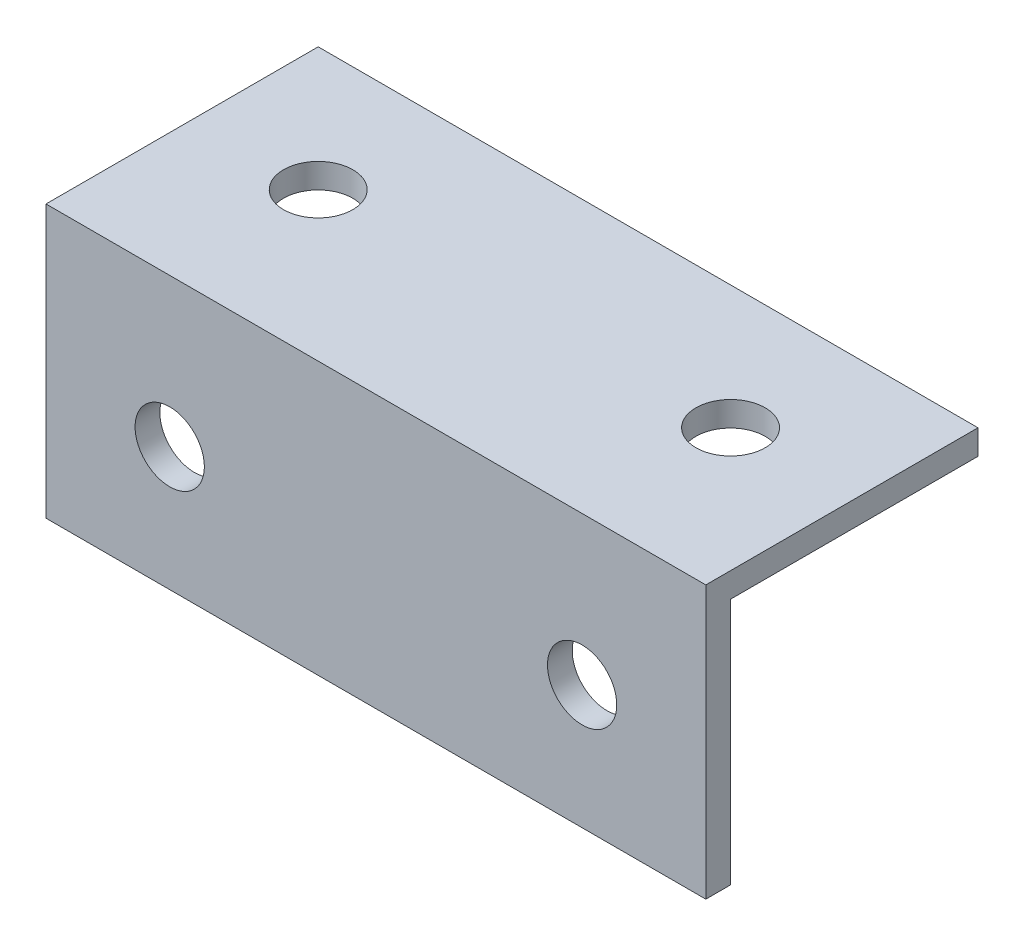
ISO-10303-21;
HEADER;
FILE_DESCRIPTION(('STEP AP214'),'2;1');
FILE_NAME('part.step','',(''),(''),'','','');
FILE_SCHEMA(('AUTOMOTIVE_DESIGN { 1 0 10303 214 1 1 1 1 }'));
ENDSEC;
DATA;
#1=APPLICATION_CONTEXT('core data for automotive mechanical design processes');
#2=APPLICATION_PROTOCOL_DEFINITION('international standard','automotive_design',2000,#1);
#3=PRODUCT_CONTEXT('',#1,'mechanical');
#4=PRODUCT('Part','Part','',(#3));
#5=PRODUCT_RELATED_PRODUCT_CATEGORY('part','',(#4));
#6=PRODUCT_DEFINITION_FORMATION('','',#4);
#7=PRODUCT_DEFINITION_CONTEXT('part definition',#1,'design');
#8=PRODUCT_DEFINITION('design','',#6,#7);
#9=PRODUCT_DEFINITION_SHAPE('','',#8);
#10=(LENGTH_UNIT() NAMED_UNIT(*) SI_UNIT(.MILLI.,.METRE.));
#11=(NAMED_UNIT(*) PLANE_ANGLE_UNIT() SI_UNIT($,.RADIAN.));
#12=(NAMED_UNIT(*) SI_UNIT($,.STERADIAN.) SOLID_ANGLE_UNIT());
#13=UNCERTAINTY_MEASURE_WITH_UNIT(LENGTH_MEASURE(1.E-05),#10,'distance_accuracy_value','');
#14=(GEOMETRIC_REPRESENTATION_CONTEXT(3) GLOBAL_UNCERTAINTY_ASSIGNED_CONTEXT((#13)) GLOBAL_UNIT_ASSIGNED_CONTEXT((#10,
#11,#12)) REPRESENTATION_CONTEXT('',''));
#15=CARTESIAN_POINT('',(0.,0.,0.));
#16=DIRECTION('',(0.,0.,1.));
#17=DIRECTION('',(1.,0.,0.));
#18=AXIS2_PLACEMENT_3D('',#15,#16,#17);
#19=CARTESIAN_POINT('',(50.8000000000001,-19.05,1.90499999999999));
#20=DIRECTION('',(0.,1.,0.));
#21=DIRECTION('',(0.,0.,1.));
#22=AXIS2_PLACEMENT_3D('',#19,#20,#21);
#23=PLANE('',#22);
#24=DIRECTION('',(0.,0.,-1.));
#25=VECTOR('',#24,1.);
#26=CARTESIAN_POINT('',(0.,-19.05,1.90499999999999));
#27=LINE('',#26,#25);
#28=CARTESIAN_POINT('',(0.,-19.05,1.90499999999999));
#29=VERTEX_POINT('',#28);
#30=CARTESIAN_POINT('',(0.,-19.05,0.));
#31=VERTEX_POINT('',#30);
#32=EDGE_CURVE('E140',#29,#31,#27,.T.);
#33=ORIENTED_EDGE('',*,*,#32,.T.);
#34=DIRECTION('',(-1.,0.,0.));
#35=VECTOR('',#34,1.);
#36=CARTESIAN_POINT('',(50.8000000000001,-19.05,0.));
#37=LINE('',#36,#35);
#38=CARTESIAN_POINT('',(50.8000000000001,-19.05,0.));
#39=VERTEX_POINT('',#38);
#40=EDGE_CURVE('E11',#39,#31,#37,.T.);
#41=ORIENTED_EDGE('',*,*,#40,.F.);
#42=DIRECTION('',(0.,0.,-1.));
#43=VECTOR('',#42,1.);
#44=CARTESIAN_POINT('',(50.8000000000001,-19.05,1.90499999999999));
#45=LINE('',#44,#43);
#46=CARTESIAN_POINT('',(50.8000000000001,-19.05,1.90499999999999));
#47=VERTEX_POINT('',#46);
#48=EDGE_CURVE('E152',#47,#39,#45,.T.);
#49=ORIENTED_EDGE('',*,*,#48,.F.);
#50=DIRECTION('',(-1.,0.,0.));
#51=VECTOR('',#50,1.);
#52=CARTESIAN_POINT('',(50.8000000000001,-19.05,1.90499999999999));
#53=LINE('',#52,#51);
#54=EDGE_CURVE('E135',#47,#29,#53,.T.);
#55=ORIENTED_EDGE('',*,*,#54,.T.);
#56=EDGE_LOOP('',(#33,#41,#49,#55));
#57=FACE_BOUND('',#56,.T.);
#58=ADVANCED_FACE('F50',(#57),#23,.F.);
#59=CARTESIAN_POINT('',(50.8000000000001,-19.05,0.));
#60=DIRECTION('',(0.,0.,1.));
#61=DIRECTION('',(1.,0.,0.));
#62=AXIS2_PLACEMENT_3D('',#59,#60,#61);
#63=PLANE('',#62);
#64=CARTESIAN_POINT('',(9.52500000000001,-9.52500000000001,0.));
#65=DIRECTION('',(0.,0.,1.));
#66=DIRECTION('',(1.,0.,0.));
#67=AXIS2_PLACEMENT_3D('',#64,#65,#66);
#68=CIRCLE('',#67,2.667);
#69=CARTESIAN_POINT('',(12.192,-9.52500000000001,0.));
#70=VERTEX_POINT('',#69);
#71=EDGE_CURVE('E142',#70,#70,#68,.T.);
#72=ORIENTED_EDGE('',*,*,#71,.T.);
#73=EDGE_LOOP('',(#72));
#74=FACE_BOUND('',#73,.T.);
#75=CARTESIAN_POINT('',(41.2750000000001,-9.52500000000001,0.));
#76=DIRECTION('',(0.,0.,1.));
#77=DIRECTION('',(1.,0.,0.));
#78=AXIS2_PLACEMENT_3D('',#75,#76,#77);
#79=CIRCLE('',#78,2.667);
#80=CARTESIAN_POINT('',(43.9420000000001,-9.52500000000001,0.));
#81=VERTEX_POINT('',#80);
#82=EDGE_CURVE('E278',#81,#81,#79,.T.);
#83=ORIENTED_EDGE('',*,*,#82,.T.);
#84=EDGE_LOOP('',(#83));
#85=FACE_BOUND('',#84,.T.);
#86=DIRECTION('',(0.,1.,0.));
#87=VECTOR('',#86,1.);
#88=CARTESIAN_POINT('',(0.,-19.05,0.));
#89=LINE('',#88,#87);
#90=CARTESIAN_POINT('',(0.,0.,0.));
#91=VERTEX_POINT('',#90);
#92=EDGE_CURVE('E143',#31,#91,#89,.T.);
#93=ORIENTED_EDGE('',*,*,#92,.T.);
#94=DIRECTION('',(-1.,0.,0.));
#95=VECTOR('',#94,1.);
#96=CARTESIAN_POINT('',(50.8000000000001,0.,0.));
#97=LINE('',#96,#95);
#98=CARTESIAN_POINT('',(50.8000000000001,0.,0.));
#99=VERTEX_POINT('',#98);
#100=EDGE_CURVE('E57',#99,#91,#97,.T.);
#101=ORIENTED_EDGE('',*,*,#100,.F.);
#102=DIRECTION('',(0.,1.,0.));
#103=VECTOR('',#102,1.);
#104=CARTESIAN_POINT('',(50.8000000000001,-19.05,0.));
#105=LINE('',#104,#103);
#106=EDGE_CURVE('E101',#39,#99,#105,.T.);
#107=ORIENTED_EDGE('',*,*,#106,.F.);
#108=ORIENTED_EDGE('',*,*,#40,.T.);
#109=EDGE_LOOP('',(#93,#101,#107,#108));
#110=FACE_BOUND('',#109,.T.);
#111=ADVANCED_FACE('F190',(#74,#85,#110),#63,.F.);
#112=CARTESIAN_POINT('',(50.8000000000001,0.,0.));
#113=DIRECTION('',(0.,1.,0.));
#114=DIRECTION('',(0.,0.,1.));
#115=AXIS2_PLACEMENT_3D('',#112,#113,#114);
#116=PLANE('',#115);
#117=CARTESIAN_POINT('',(9.52500000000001,0.,-9.52500000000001));
#118=DIRECTION('',(0.,1.,0.));
#119=DIRECTION('',(0.,0.,1.));
#120=AXIS2_PLACEMENT_3D('',#117,#118,#119);
#121=CIRCLE('',#120,2.667);
#122=CARTESIAN_POINT('',(9.52500000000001,0.,-6.85800000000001));
#123=VERTEX_POINT('',#122);
#124=EDGE_CURVE('E263',#123,#123,#121,.T.);
#125=ORIENTED_EDGE('',*,*,#124,.T.);
#126=EDGE_LOOP('',(#125));
#127=FACE_BOUND('',#126,.T.);
#128=CARTESIAN_POINT('',(41.2750000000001,0.,-9.52500000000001));
#129=DIRECTION('',(0.,1.,0.));
#130=DIRECTION('',(0.,0.,1.));
#131=AXIS2_PLACEMENT_3D('',#128,#129,#130);
#132=CIRCLE('',#131,2.667);
#133=CARTESIAN_POINT('',(41.2750000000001,0.,-6.858));
#134=VERTEX_POINT('',#133);
#135=EDGE_CURVE('E266',#134,#134,#132,.T.);
#136=ORIENTED_EDGE('',*,*,#135,.T.);
#137=EDGE_LOOP('',(#136));
#138=FACE_BOUND('',#137,.T.);
#139=DIRECTION('',(0.,0.,-1.));
#140=VECTOR('',#139,1.);
#141=CARTESIAN_POINT('',(0.,0.,0.));
#142=LINE('',#141,#140);
#143=CARTESIAN_POINT('',(0.,0.,-19.05));
#144=VERTEX_POINT('',#143);
#145=EDGE_CURVE('E144',#91,#144,#142,.T.);
#146=ORIENTED_EDGE('',*,*,#145,.T.);
#147=DIRECTION('',(-1.,0.,0.));
#148=VECTOR('',#147,1.);
#149=CARTESIAN_POINT('',(50.8000000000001,0.,-19.05));
#150=LINE('',#149,#148);
#151=CARTESIAN_POINT('',(50.8000000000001,0.,-19.05));
#152=VERTEX_POINT('',#151);
#153=EDGE_CURVE('E124',#152,#144,#150,.T.);
#154=ORIENTED_EDGE('',*,*,#153,.F.);
#155=DIRECTION('',(0.,0.,-1.));
#156=VECTOR('',#155,1.);
#157=CARTESIAN_POINT('',(50.8000000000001,0.,0.));
#158=LINE('',#157,#156);
#159=EDGE_CURVE('E111',#99,#152,#158,.T.);
#160=ORIENTED_EDGE('',*,*,#159,.F.);
#161=ORIENTED_EDGE('',*,*,#100,.T.);
#162=EDGE_LOOP('',(#146,#154,#160,#161));
#163=FACE_BOUND('',#162,.T.);
#164=ADVANCED_FACE('F164',(#127,#138,#163),#116,.F.);
#165=CARTESIAN_POINT('',(50.8000000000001,0.,-19.05));
#166=DIRECTION('',(0.,0.,1.));
#167=DIRECTION('',(1.,0.,0.));
#168=AXIS2_PLACEMENT_3D('',#165,#166,#167);
#169=PLANE('',#168);
#170=DIRECTION('',(0.,1.,0.));
#171=VECTOR('',#170,1.);
#172=CARTESIAN_POINT('',(0.,0.,-19.05));
#173=LINE('',#172,#171);
#174=CARTESIAN_POINT('',(0.,1.90499999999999,-19.05));
#175=VERTEX_POINT('',#174);
#176=EDGE_CURVE('E123',#144,#175,#173,.T.);
#177=ORIENTED_EDGE('',*,*,#176,.T.);
#178=DIRECTION('',(-1.,0.,0.));
#179=VECTOR('',#178,1.);
#180=CARTESIAN_POINT('',(50.8000000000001,1.90499999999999,-19.05));
#181=LINE('',#180,#179);
#182=CARTESIAN_POINT('',(50.8000000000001,1.90499999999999,-19.05));
#183=VERTEX_POINT('',#182);
#184=EDGE_CURVE('E117',#183,#175,#181,.T.);
#185=ORIENTED_EDGE('',*,*,#184,.F.);
#186=DIRECTION('',(0.,1.,0.));
#187=VECTOR('',#186,1.);
#188=CARTESIAN_POINT('',(50.8000000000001,0.,-19.05));
#189=LINE('',#188,#187);
#190=EDGE_CURVE('E107',#152,#183,#189,.T.);
#191=ORIENTED_EDGE('',*,*,#190,.F.);
#192=ORIENTED_EDGE('',*,*,#153,.T.);
#193=EDGE_LOOP('',(#177,#185,#191,#192));
#194=FACE_BOUND('',#193,.T.);
#195=ADVANCED_FACE('F121',(#194),#169,.F.);
#196=CARTESIAN_POINT('',(50.8000000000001,1.90499999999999,-19.05));
#197=DIRECTION('',(0.,-1.,0.));
#198=DIRECTION('',(0.,0.,-1.));
#199=AXIS2_PLACEMENT_3D('',#196,#197,#198);
#200=PLANE('',#199);
#201=CARTESIAN_POINT('',(9.52500000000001,1.90499999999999,-9.52500000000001));
#202=DIRECTION('',(0.,1.,0.));
#203=DIRECTION('',(0.,0.,1.));
#204=AXIS2_PLACEMENT_3D('',#201,#202,#203);
#205=CIRCLE('',#204,2.667);
#206=CARTESIAN_POINT('',(9.52500000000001,1.90499999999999,-6.85800000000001));
#207=VERTEX_POINT('',#206);
#208=EDGE_CURVE('E257',#207,#207,#205,.T.);
#209=ORIENTED_EDGE('',*,*,#208,.F.);
#210=EDGE_LOOP('',(#209));
#211=FACE_BOUND('',#210,.T.);
#212=CARTESIAN_POINT('',(41.2750000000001,1.90499999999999,-9.52500000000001));
#213=DIRECTION('',(0.,1.,0.));
#214=DIRECTION('',(0.,0.,1.));
#215=AXIS2_PLACEMENT_3D('',#212,#213,#214);
#216=CIRCLE('',#215,2.667);
#217=CARTESIAN_POINT('',(41.2750000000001,1.90499999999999,-6.858));
#218=VERTEX_POINT('',#217);
#219=EDGE_CURVE('E324',#218,#218,#216,.T.);
#220=ORIENTED_EDGE('',*,*,#219,.F.);
#221=EDGE_LOOP('',(#220));
#222=FACE_BOUND('',#221,.T.);
#223=DIRECTION('',(0.,0.,1.));
#224=VECTOR('',#223,1.);
#225=CARTESIAN_POINT('',(0.,1.90499999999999,-19.05));
#226=LINE('',#225,#224);
#227=CARTESIAN_POINT('',(0.,1.90499999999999,1.90499999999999));
#228=VERTEX_POINT('',#227);
#229=EDGE_CURVE('E87',#175,#228,#226,.T.);
#230=ORIENTED_EDGE('',*,*,#229,.T.);
#231=DIRECTION('',(-1.,0.,0.));
#232=VECTOR('',#231,1.);
#233=CARTESIAN_POINT('',(50.8000000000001,1.90499999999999,1.90499999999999));
#234=LINE('',#233,#232);
#235=CARTESIAN_POINT('',(50.8000000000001,1.90499999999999,1.90499999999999));
#236=VERTEX_POINT('',#235);
#237=EDGE_CURVE('E127',#236,#228,#234,.T.);
#238=ORIENTED_EDGE('',*,*,#237,.F.);
#239=DIRECTION('',(0.,0.,1.));
#240=VECTOR('',#239,1.);
#241=CARTESIAN_POINT('',(50.8000000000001,1.90499999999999,-19.05));
#242=LINE('',#241,#240);
#243=EDGE_CURVE('E115',#183,#236,#242,.T.);
#244=ORIENTED_EDGE('',*,*,#243,.F.);
#245=ORIENTED_EDGE('',*,*,#184,.T.);
#246=EDGE_LOOP('',(#230,#238,#244,#245));
#247=FACE_BOUND('',#246,.T.);
#248=ADVANCED_FACE('F126',(#211,#222,#247),#200,.F.);
#249=CARTESIAN_POINT('',(50.8000000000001,1.90499999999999,1.90499999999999));
#250=DIRECTION('',(0.,0.,-1.));
#251=DIRECTION('',(-1.,0.,0.));
#252=AXIS2_PLACEMENT_3D('',#249,#250,#251);
#253=PLANE('',#252);
#254=CARTESIAN_POINT('',(9.52500000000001,-9.52500000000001,1.90499999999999));
#255=DIRECTION('',(0.,0.,1.));
#256=DIRECTION('',(1.,0.,0.));
#257=AXIS2_PLACEMENT_3D('',#254,#255,#256);
#258=CIRCLE('',#257,2.667);
#259=CARTESIAN_POINT('',(12.192,-9.52500000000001,1.90499999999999));
#260=VERTEX_POINT('',#259);
#261=EDGE_CURVE('E275',#260,#260,#258,.T.);
#262=ORIENTED_EDGE('',*,*,#261,.F.);
#263=EDGE_LOOP('',(#262));
#264=FACE_BOUND('',#263,.T.);
#265=CARTESIAN_POINT('',(41.2750000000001,-9.52500000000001,1.90499999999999));
#266=DIRECTION('',(0.,0.,1.));
#267=DIRECTION('',(1.,0.,0.));
#268=AXIS2_PLACEMENT_3D('',#265,#266,#267);
#269=CIRCLE('',#268,2.667);
#270=CARTESIAN_POINT('',(43.9420000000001,-9.52500000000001,1.90499999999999));
#271=VERTEX_POINT('',#270);
#272=EDGE_CURVE('E264',#271,#271,#269,.T.);
#273=ORIENTED_EDGE('',*,*,#272,.F.);
#274=EDGE_LOOP('',(#273));
#275=FACE_BOUND('',#274,.T.);
#276=DIRECTION('',(0.,-1.,0.));
#277=VECTOR('',#276,1.);
#278=CARTESIAN_POINT('',(0.,1.90499999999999,1.90499999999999));
#279=LINE('',#278,#277);
#280=EDGE_CURVE('E91',#228,#29,#279,.T.);
#281=ORIENTED_EDGE('',*,*,#280,.T.);
#282=ORIENTED_EDGE('',*,*,#54,.F.);
#283=DIRECTION('',(0.,-1.,0.));
#284=VECTOR('',#283,1.);
#285=CARTESIAN_POINT('',(50.8000000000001,1.90499999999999,1.90499999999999));
#286=LINE('',#285,#284);
#287=EDGE_CURVE('E63',#236,#47,#286,.T.);
#288=ORIENTED_EDGE('',*,*,#287,.F.);
#289=ORIENTED_EDGE('',*,*,#237,.T.);
#290=EDGE_LOOP('',(#281,#282,#288,#289));
#291=FACE_BOUND('',#290,.T.);
#292=ADVANCED_FACE('F171',(#264,#275,#291),#253,.F.);
#293=CARTESIAN_POINT('',(50.8000000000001,0.,0.));
#294=DIRECTION('',(1.,0.,0.));
#295=DIRECTION('',(0.,0.,-1.));
#296=AXIS2_PLACEMENT_3D('',#293,#294,#295);
#297=PLANE('',#296);
#298=ORIENTED_EDGE('',*,*,#48,.T.);
#299=ORIENTED_EDGE('',*,*,#106,.T.);
#300=ORIENTED_EDGE('',*,*,#159,.T.);
#301=ORIENTED_EDGE('',*,*,#190,.T.);
#302=ORIENTED_EDGE('',*,*,#243,.T.);
#303=ORIENTED_EDGE('',*,*,#287,.T.);
#304=EDGE_LOOP('',(#298,#299,#300,#301,#302,#303));
#305=FACE_BOUND('',#304,.T.);
#306=ADVANCED_FACE('F109',(#305),#297,.T.);
#307=CARTESIAN_POINT('',(0.,0.,0.));
#308=DIRECTION('',(1.,0.,0.));
#309=DIRECTION('',(0.,0.,-1.));
#310=AXIS2_PLACEMENT_3D('',#307,#308,#309);
#311=PLANE('',#310);
#312=ORIENTED_EDGE('',*,*,#32,.F.);
#313=ORIENTED_EDGE('',*,*,#280,.F.);
#314=ORIENTED_EDGE('',*,*,#229,.F.);
#315=ORIENTED_EDGE('',*,*,#176,.F.);
#316=ORIENTED_EDGE('',*,*,#145,.F.);
#317=ORIENTED_EDGE('',*,*,#92,.F.);
#318=EDGE_LOOP('',(#312,#313,#314,#315,#316,#317));
#319=FACE_BOUND('',#318,.T.);
#320=ADVANCED_FACE('F169',(#319),#311,.F.);
#321=CARTESIAN_POINT('',(41.2750000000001,-9.52500000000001,-19.05));
#322=DIRECTION('',(0.,0.,1.));
#323=DIRECTION('',(1.,0.,0.));
#324=AXIS2_PLACEMENT_3D('',#321,#322,#323);
#325=CYLINDRICAL_SURFACE('',#324,2.667);
#326=ORIENTED_EDGE('',*,*,#272,.T.);
#327=EDGE_LOOP('',(#326));
#328=FACE_BOUND('',#327,.T.);
#329=ORIENTED_EDGE('',*,*,#82,.F.);
#330=EDGE_LOOP('',(#329));
#331=FACE_BOUND('',#330,.T.);
#332=ADVANCED_FACE('F221',(#328,#331),#325,.F.);
#333=CARTESIAN_POINT('',(9.52500000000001,-9.52500000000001,-19.05));
#334=DIRECTION('',(0.,0.,1.));
#335=DIRECTION('',(1.,0.,0.));
#336=AXIS2_PLACEMENT_3D('',#333,#334,#335);
#337=CYLINDRICAL_SURFACE('',#336,2.667);
#338=ORIENTED_EDGE('',*,*,#261,.T.);
#339=EDGE_LOOP('',(#338));
#340=FACE_BOUND('',#339,.T.);
#341=ORIENTED_EDGE('',*,*,#71,.F.);
#342=EDGE_LOOP('',(#341));
#343=FACE_BOUND('',#342,.T.);
#344=ADVANCED_FACE('F227',(#340,#343),#337,.F.);
#345=CARTESIAN_POINT('',(41.2750000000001,-19.05,-9.52500000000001));
#346=DIRECTION('',(0.,1.,0.));
#347=DIRECTION('',(0.,0.,1.));
#348=AXIS2_PLACEMENT_3D('',#345,#346,#347);
#349=CYLINDRICAL_SURFACE('',#348,2.667);
#350=ORIENTED_EDGE('',*,*,#219,.T.);
#351=EDGE_LOOP('',(#350));
#352=FACE_BOUND('',#351,.T.);
#353=ORIENTED_EDGE('',*,*,#135,.F.);
#354=EDGE_LOOP('',(#353));
#355=FACE_BOUND('',#354,.T.);
#356=ADVANCED_FACE('F236',(#352,#355),#349,.F.);
#357=CARTESIAN_POINT('',(9.52500000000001,-19.05,-9.52500000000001));
#358=DIRECTION('',(0.,1.,0.));
#359=DIRECTION('',(0.,0.,1.));
#360=AXIS2_PLACEMENT_3D('',#357,#358,#359);
#361=CYLINDRICAL_SURFACE('',#360,2.667);
#362=ORIENTED_EDGE('',*,*,#208,.T.);
#363=EDGE_LOOP('',(#362));
#364=FACE_BOUND('',#363,.T.);
#365=ORIENTED_EDGE('',*,*,#124,.F.);
#366=EDGE_LOOP('',(#365));
#367=FACE_BOUND('',#366,.T.);
#368=ADVANCED_FACE('F246',(#364,#367),#361,.F.);
#369=CLOSED_SHELL('',(#58,#111,#164,#195,#248,#292,#306,#320,#332,#344,#356,#368));
#370=MANIFOLD_SOLID_BREP('B2',#369);
#371=ADVANCED_BREP_SHAPE_REPRESENTATION('',(#18,#370),#14);
#372=SHAPE_DEFINITION_REPRESENTATION(#9,#371);
ENDSEC;
END-ISO-10303-21;
